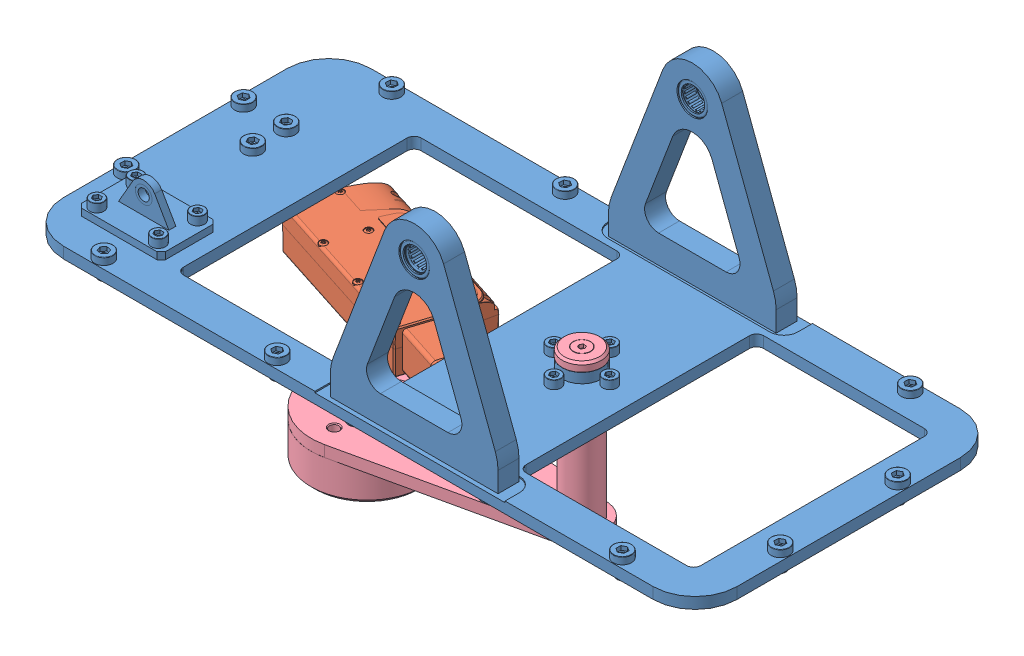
SolidWorks assembly Orientation_Surcharge.SLDASM, configuration Défaut (file format 12000). Lengths in mm.
Overall size (482 261 220).
4 component instances, 4 part files, 6 mates.
Components (placement in the parent):
- structure-1: structure.SLDPRT [Défaut] at (-42.7877 -69.6581 482) size (482 166.2 220)
- corps_verin-1: corps_verin.SLDPRT [Défaut] at (-148.1171 -92.8081 462.5941) x (-0.305615 0 0.952155) z (-0.952155 0 -0.305615) size (61.61 33.46 185.99)
- tige_verin-1: tige_verin.SLDPRT [Défaut] at (-142.9981 -92.7581 478.5731) x (0 -1 0) z (-0.952155 0 -0.305615) size (29.4 20.4 138.61)
- surcharge-1: surcharge.SLDPRT [Défaut] at (7.2123 -161.1581 482) x (0.998048 0 -0.062458) z (0.062458 0 0.998048) size (202.5 137.75 84.47)
Mates (geometry in assembly coordinates):
- Coaxiale1: concentric anti-aligned: cylinder of structure-1 through (-225.7877 -90.3581 452) axis (0 -1 0) radius 4; cylinder of corps_verin-1 through (-225.7877 -86.2791 452) axis (0 1 0) radius 4
- Coïncidente1: coincident anti-aligned: plane of structure-1 through (-225.7877 -95.3581 452) normal (0 -1 0); plane of corps_verin-1 through (-211.4784 -95.3581 447.6657) normal (0 1 0)
- Coaxiale2: concentric aligned: cylinder of corps_verin-1 through (-70.1178 -92.7581 501.9656) axis (0.952155 0 0.305615) radius 8.5; cylinder of tige_verin-1 through (-133.4766 -92.7581 481.6292) axis (0.952155 0 0.305615) radius 8.5
- Coaxiale3: concentric anti-aligned: cylinder of structure-1 through (7.2123 -89.8581 482) axis (0 -1 0) radius 10; cylinder of surcharge-1 through (7.2123 -58.4581 482) axis (0 1 0) radius 10
- Coaxiale4: concentric anti-aligned: cylinder of tige_verin-1 through (-19.5036 -86.2791 518.2113) axis (0 1 0) radius 4; cylinder of surcharge-1 through (-19.5036 -90.1581 518.2113) axis (0 -1 0) radius 6
- Coïncidente2: coincident anti-aligned: plane of tige_verin-1 through (-19.5036 -90.1581 518.2113) normal (0 -1 0); plane of surcharge-1 through (7.2123 -90.1581 482) normal (0 1 0)
